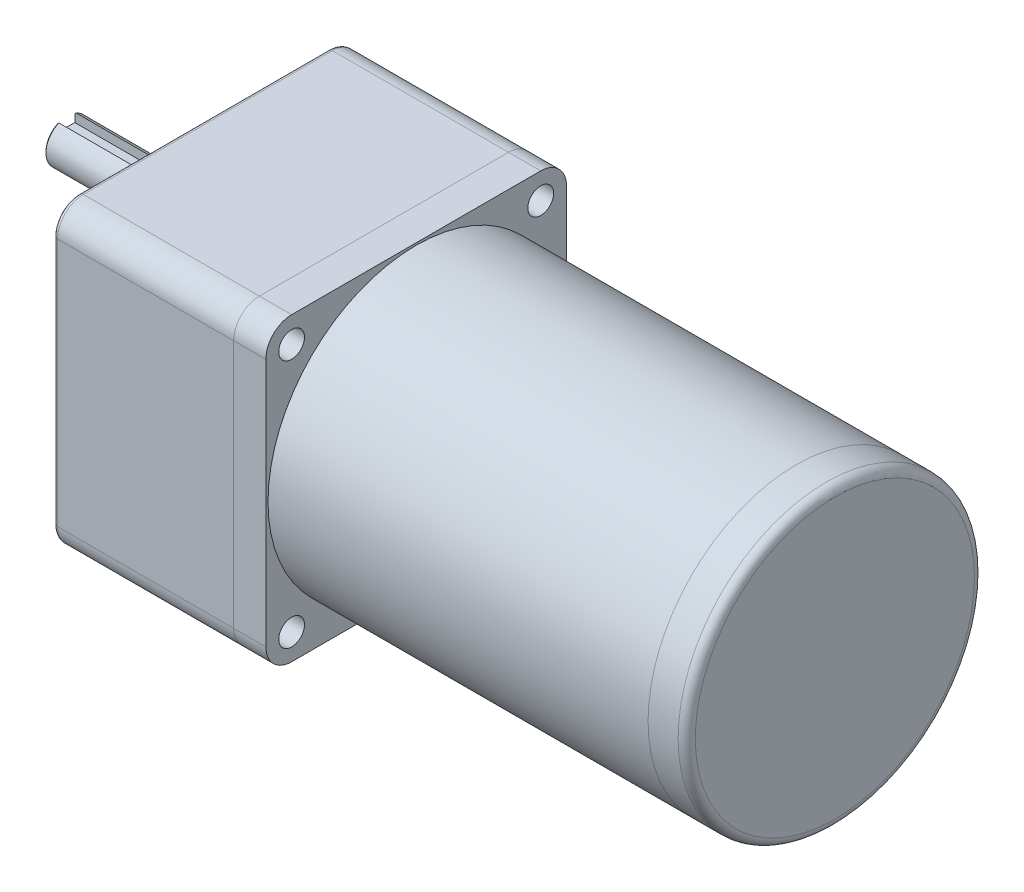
from build123d import *

# Parameters (mm, degrees)
EXTRUDE_1_DEPTH             = 42
EXTRUDE_2_DEPTH             = 7.5
FILLET_1_R                  = 1
HOLE_WIZARD_M5_1_AT_2_COUNT = 2
HOLE_WIZARD_M5_1_AT_2_PITCH = 57.982756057
HOLE_WIZARD_M5_1_AT_3_COUNT = 2
HOLE_WIZARD_M5_1_AT_3_PITCH = 82
HOLE_WIZARD_M5_1_AT_4_COUNT = 2
HOLE_WIZARD_M5_1_AT_4_PITCH = 57.982756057
SKETCH_7_R                  = 3
CUT_EXTRUDE_1_DEPTH         = 35.5
SKETCH_8_R                  = 12
EXTRUDE_5_DEPTH             = 3
SKETCH_9_R                  = 5
EXTRUDE_6_DEPTH             = 29
FILLET_3_R                  = 0.5
SKETCH_10_R                 = 30
CUT_EXTRUDE_2_DEPTH         = 0.5
CUT_EXTRUDE_3_DEPTH         = 2.5
CHAMFER_1_SIZE              = 0.3
SKETCH_12_R                 = 34.5
EXTRUDE_7_DEPTH             = 88.5
SKETCH_13_R                 = 34.5
EXTRUDE_8_DEPTH             = 9
FILLET_4_R                  = 2


with BuildPart() as part:
    # Sketch 1 → Extrude 1 (new body)
    with BuildSketch(Plane(origin=(0, 0, 0), x_dir=(0, 0, -1), z_dir=(1, 0, 0))):
        with BuildLine():
            Line((29, -35), (-29, -35))
            ThreePointArc((-29, -35), (-33.242640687, -33.242640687), (-35, -29))
            Line((-35, -29), (-35, 29))
            ThreePointArc((-35, 29), (-33.242640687, 33.242640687), (-29, 35))
            Line((-29, 35), (29, 35))
            ThreePointArc((29, 35), (33.242640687, 33.242640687), (35, 29))
            Line((35, 29), (35, -29))
            ThreePointArc((35, -29), (33.242640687, -33.242640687), (29, -35))
        make_face()
    extrude(amount=EXTRUDE_1_DEPTH)

    # Fillet 1
    fillet_1_edges = [part.edges().sort_by_distance(p)[0] for p in [
        (0, -35, 0),
        (0, -33.242640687, 33.242640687),
        (0, 0, 35),
        (0, 33.242640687, 33.242640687),
        (0, 35, 0),
        (0, 33.242640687, -33.242640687),
        (0, 0, -35),
        (0, -33.242640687, -33.242640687),
    ]]
    fillet(fillet_1_edges, radius=FILLET_1_R)

    # Sketch 6 → Hole Wizard M5 _1 (revolve, cut)
    with BuildSketch(Plane(origin=(0, 28.991378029, -28.991378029), x_dir=(0, 0, 1), z_dir=(0, 1, 0))):
        Polygon((0, 0), (0, 15.2618073), (2.1, 14), (2.1, 0), align=None)
    hole_wizard_m5_1 = revolve(axis=Axis((-6.35, 28.991378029, -28.991378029), (1, 0, 0)), mode=Mode.SUBTRACT)

    # Hole Wizard M5 _1 at 2: Hole Wizard M5 _1 ×2
    with Locations(*[(0, -i * HOLE_WIZARD_M5_1_AT_2_PITCH, 0) for i in range(1, HOLE_WIZARD_M5_1_AT_2_COUNT)]):
        add(hole_wizard_m5_1, mode=Mode.SUBTRACT)

    # Hole Wizard M5 _1 at 3: Hole Wizard M5 _1 ×2
    with Locations(*[Vector(0, -0.7071067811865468, 0.7071067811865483) * (i * HOLE_WIZARD_M5_1_AT_3_PITCH) for i in range(1, HOLE_WIZARD_M5_1_AT_3_COUNT)]):
        add(hole_wizard_m5_1, mode=Mode.SUBTRACT)

    # Hole Wizard M5 _1 at 4: Hole Wizard M5 _1 ×2
    with Locations(*[(0, 0, i * HOLE_WIZARD_M5_1_AT_4_PITCH) for i in range(1, HOLE_WIZARD_M5_1_AT_4_COUNT)]):
        add(hole_wizard_m5_1, mode=Mode.SUBTRACT)


with BuildPart() as body_2:
    # Sketch 2 → Extrude 2 (new body)
    with BuildSketch(Plane(origin=(42, 0, 0), x_dir=(0, 0, -1), z_dir=(1, 0, 0))):
        with BuildLine():
            Line((-29, -35), (29, -35))
            ThreePointArc((29, -35), (33.242640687, -33.242640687), (35, -29))
            Line((35, -29), (35, 29))
            ThreePointArc((35, 29), (33.242640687, 33.242640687), (29, 35))
            Line((29, 35), (-29, 35))
            ThreePointArc((-29, 35), (-33.242640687, 33.242640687), (-35, 29))
            Line((-35, 29), (-35, -29))
            ThreePointArc((-35, -29), (-33.242640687, -33.242640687), (-29, -35))
        make_face()
    extrude(amount=EXTRUDE_2_DEPTH)


with BuildPart() as cut_extrude_1_tool:
    # Sketch 7 → Cut-Extrude 1 (new body)
    with BuildSketch(Plane(origin=(49.5, 0, 0), x_dir=(0, 0, -1), z_dir=(1, 0, 0))):
        with Locations((-29, 29)):
            Circle(SKETCH_7_R)
        with Locations((29, 29)):
            Circle(SKETCH_7_R)
        with Locations((29, -29)):
            Circle(SKETCH_7_R)
        with Locations((-29, -29)):
            Circle(SKETCH_7_R)
    extrude(amount=-CUT_EXTRUDE_1_DEPTH)


with BuildPart() as part_1:
    add(part.part)

    # Cut-Extrude 1: cut by cut_extrude_1_tool
    add(cut_extrude_1_tool.part, mode=Mode.SUBTRACT)

    # Sketch 10 → Cut-Extrude 2 (cut)
    with BuildSketch(Plane.ZY):
        Circle(SKETCH_10_R)
    extrude(amount=-CUT_EXTRUDE_2_DEPTH, mode=Mode.SUBTRACT)


with BuildPart() as body_2_1:
    add(body_2.part)

    # Cut-Extrude 1: cut by cut_extrude_1_tool
    add(cut_extrude_1_tool.part, mode=Mode.SUBTRACT)


with BuildPart() as body_3:
    # Sketch 8 → Extrude 5 (new body)
    with BuildSketch(Plane.ZY):
        with Locations((0, 15)):
            Circle(SKETCH_8_R)
    extrude(amount=EXTRUDE_5_DEPTH)

    # Fillet 3
    fillet_3_edges = [body_3.edges().sort_by_distance(p)[0] for p in [
        (-3, 15, -12),
    ]]
    fillet(fillet_3_edges, radius=FILLET_3_R)


with BuildPart() as body_4:
    # Sketch 9 → Extrude 6 (new body)
    with BuildSketch(Plane.ZY.offset(3)):
        with Locations(Location((0, 15, 0), (0, 0, 180))):
            Circle(SKETCH_9_R)
    extrude(amount=EXTRUDE_6_DEPTH)

    # Sketch 11 → Cut-Extrude 3 (cut)
    with BuildSketch(Plane(origin=(0, 20, 0), x_dir=(1, 0, 0), z_dir=(0, 1, 0))):
        with BuildLine():
            Line((-9, 2), (-32, 2))
            Line((-32, 2), (-32, -2))
            Line((-32, -2), (-9, -2))
            ThreePointArc((-9, -2), (-7, 0), (-9, 2))
        make_face()
    extrude(amount=-CUT_EXTRUDE_3_DEPTH, mode=Mode.SUBTRACT)

    # Chamfer 1
    chamfer_1_edges = [body_4.edges().sort_by_distance(p)[0] for p in [
        (-32, 10.816699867, 2.738612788),
    ]]
    chamfer(chamfer_1_edges, length=CHAMFER_1_SIZE)


with BuildPart() as body_5:
    # Sketch 12 → Extrude 7 (new body)
    with BuildSketch(Plane(origin=(49.5, 0, 0), x_dir=(0, 0, -1), z_dir=(1, 0, 0))):
        Circle(SKETCH_12_R)
    extrude(amount=EXTRUDE_7_DEPTH)


with BuildPart() as body_6:
    # Sketch 13 → Extrude 8 (new body)
    with BuildSketch(Plane(origin=(138, 0, 0), x_dir=(0, 0, -1), z_dir=(1, 0, 0))):
        Circle(SKETCH_13_R)
    extrude(amount=EXTRUDE_8_DEPTH)

    # Fillet 4
    fillet_4_edges = [body_6.edges().sort_by_distance(p)[0] for p in [
        (147, 0, 34.5),
    ]]
    fillet(fillet_4_edges, radius=FILLET_4_R)


solid = Compound([part_1.part, body_2_1.part, body_3.part, body_4.part, body_5.part, body_6.part])
